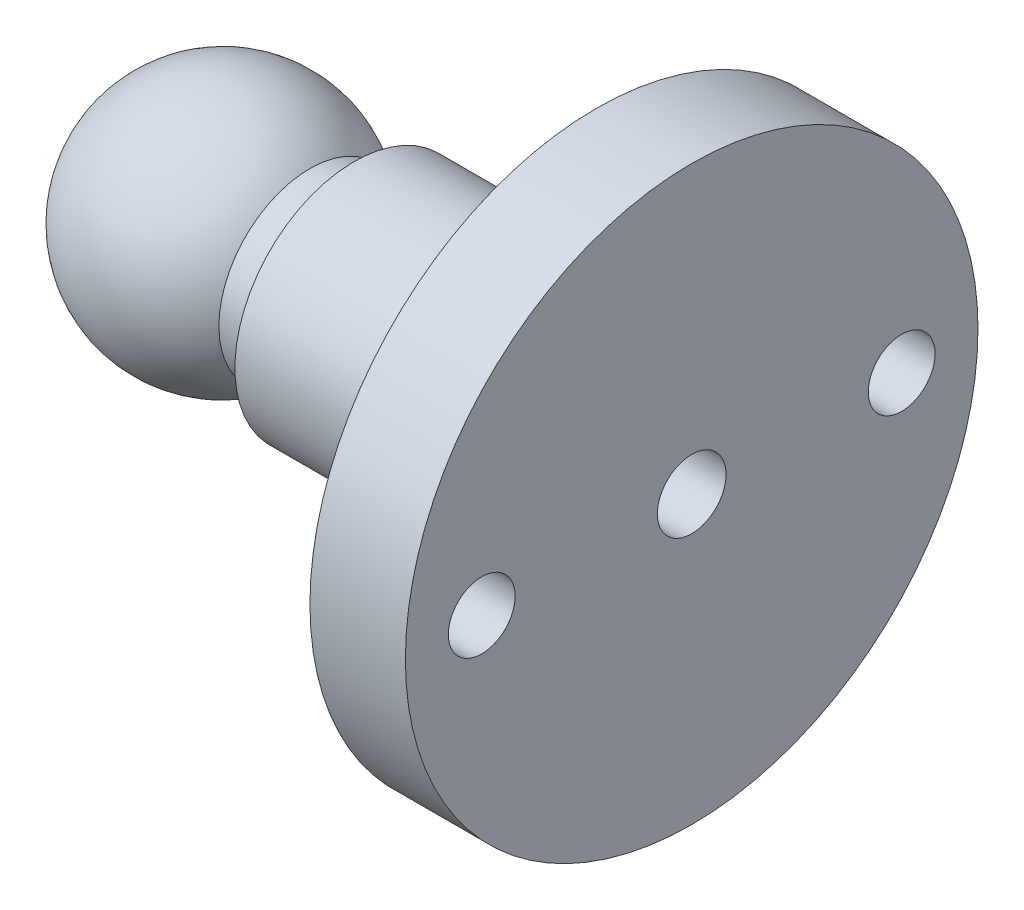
ISO-10303-21;
HEADER;
FILE_DESCRIPTION(('STEP AP214'),'2;1');
FILE_NAME('part.step','',(''),(''),'','','');
FILE_SCHEMA(('AUTOMOTIVE_DESIGN { 1 0 10303 214 1 1 1 1 }'));
ENDSEC;
DATA;
#1=APPLICATION_CONTEXT('core data for automotive mechanical design processes');
#2=APPLICATION_PROTOCOL_DEFINITION('international standard','automotive_design',2000,#1);
#3=PRODUCT_CONTEXT('',#1,'mechanical');
#4=PRODUCT('Part','Part','',(#3));
#5=PRODUCT_RELATED_PRODUCT_CATEGORY('part','',(#4));
#6=PRODUCT_DEFINITION_FORMATION('','',#4);
#7=PRODUCT_DEFINITION_CONTEXT('part definition',#1,'design');
#8=PRODUCT_DEFINITION('design','',#6,#7);
#9=PRODUCT_DEFINITION_SHAPE('','',#8);
#10=(LENGTH_UNIT() NAMED_UNIT(*) SI_UNIT(.MILLI.,.METRE.));
#11=(NAMED_UNIT(*) PLANE_ANGLE_UNIT() SI_UNIT($,.RADIAN.));
#12=(NAMED_UNIT(*) SI_UNIT($,.STERADIAN.) SOLID_ANGLE_UNIT());
#13=UNCERTAINTY_MEASURE_WITH_UNIT(LENGTH_MEASURE(1.E-05),#10,'distance_accuracy_value','');
#14=(GEOMETRIC_REPRESENTATION_CONTEXT(3) GLOBAL_UNCERTAINTY_ASSIGNED_CONTEXT((#13)) GLOBAL_UNIT_ASSIGNED_CONTEXT((#10,
#11,#12)) REPRESENTATION_CONTEXT('',''));
#15=CARTESIAN_POINT('',(0.,0.,0.));
#16=DIRECTION('',(0.,0.,1.));
#17=DIRECTION('',(1.,0.,0.));
#18=AXIS2_PLACEMENT_3D('',#15,#16,#17);
#19=CARTESIAN_POINT('',(264.840369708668,98.0251583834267,0.));
#20=DIRECTION('',(-1.,0.,0.));
#21=DIRECTION('',(0.,0.,1.));
#22=AXIS2_PLACEMENT_3D('',#19,#20,#21);
#23=PLANE('',#22);
#24=CARTESIAN_POINT('',(264.840369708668,92.5161021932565,0.));
#25=DIRECTION('',(-1.,0.,0.));
#26=DIRECTION('',(0.,0.,1.));
#27=AXIS2_PLACEMENT_3D('',#24,#25,#26);
#28=CIRCLE('',#27,4.7713832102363);
#29=CARTESIAN_POINT('',(264.840369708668,92.5161021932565,4.7713832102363));
#30=VERTEX_POINT('',#29);
#31=EDGE_CURVE('E68',#30,#30,#28,.F.);
#32=ORIENTED_EDGE('',*,*,#31,.T.);
#33=EDGE_LOOP('',(#32));
#34=FACE_BOUND('',#33,.T.);
#35=CARTESIAN_POINT('',(264.840369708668,92.5161021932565,0.));
#36=DIRECTION('',(1.,0.,0.));
#37=DIRECTION('',(0.,0.,-1.));
#38=AXIS2_PLACEMENT_3D('',#35,#36,#37);
#39=CIRCLE('',#38,6.24672917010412);
#40=CARTESIAN_POINT('',(264.840369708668,92.5161021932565,-6.24672917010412));
#41=VERTEX_POINT('',#40);
#42=EDGE_CURVE('E74',#41,#41,#39,.T.);
#43=ORIENTED_EDGE('',*,*,#42,.F.);
#44=EDGE_LOOP('',(#43));
#45=FACE_BOUND('',#44,.T.);
#46=ADVANCED_FACE('F35',(#34,#45),#23,.T.);
#47=CARTESIAN_POINT('',(271.181841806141,92.5161021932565,0.));
#48=DIRECTION('',(1.,0.,0.));
#49=DIRECTION('',(0.,0.,-1.));
#50=AXIS2_PLACEMENT_3D('',#47,#48,#49);
#51=CYLINDRICAL_SURFACE('',#50,6.24672917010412);
#52=CARTESIAN_POINT('',(277.523313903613,92.5161021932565,0.));
#53=DIRECTION('',(1.,0.,0.));
#54=DIRECTION('',(0.,0.,-1.));
#55=AXIS2_PLACEMENT_3D('',#52,#53,#54);
#56=CIRCLE('',#55,6.24672917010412);
#57=CARTESIAN_POINT('',(277.523313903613,92.5161021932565,-6.24672917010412));
#58=VERTEX_POINT('',#57);
#59=EDGE_CURVE('E92',#58,#58,#56,.T.);
#60=ORIENTED_EDGE('',*,*,#59,.F.);
#61=EDGE_LOOP('',(#60));
#62=FACE_BOUND('',#61,.T.);
#63=ORIENTED_EDGE('',*,*,#42,.T.);
#64=EDGE_LOOP('',(#63));
#65=FACE_BOUND('',#64,.T.);
#66=ADVANCED_FACE('F97',(#62,#65),#51,.T.);
#67=CARTESIAN_POINT('',(277.523313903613,103.139466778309,0.));
#68=DIRECTION('',(-1.,0.,0.));
#69=DIRECTION('',(0.,0.,1.));
#70=AXIS2_PLACEMENT_3D('',#67,#68,#69);
#71=PLANE('',#70);
#72=ORIENTED_EDGE('',*,*,#59,.T.);
#73=EDGE_LOOP('',(#72));
#74=FACE_BOUND('',#73,.T.);
#75=CARTESIAN_POINT('',(277.523313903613,92.5161021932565,0.));
#76=DIRECTION('',(1.,0.,0.));
#77=DIRECTION('',(0.,0.,-1.));
#78=AXIS2_PLACEMENT_3D('',#75,#76,#77);
#79=CIRCLE('',#78,15.);
#80=CARTESIAN_POINT('',(277.523313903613,92.5161021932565,-15.));
#81=VERTEX_POINT('',#80);
#82=EDGE_CURVE('E83',#81,#81,#79,.T.);
#83=ORIENTED_EDGE('',*,*,#82,.F.);
#84=EDGE_LOOP('',(#83));
#85=FACE_BOUND('',#84,.T.);
#86=CARTESIAN_POINT('',(277.523313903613,92.5161021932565,11.));
#87=DIRECTION('',(1.,0.,0.));
#88=DIRECTION('',(0.,0.,-1.));
#89=AXIS2_PLACEMENT_3D('',#86,#87,#88);
#90=CIRCLE('',#89,1.75);
#91=CARTESIAN_POINT('',(277.523313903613,92.5161021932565,9.25));
#92=VERTEX_POINT('',#91);
#93=EDGE_CURVE('E86',#92,#92,#90,.T.);
#94=ORIENTED_EDGE('',*,*,#93,.T.);
#95=EDGE_LOOP('',(#94));
#96=FACE_BOUND('',#95,.T.);
#97=CARTESIAN_POINT('',(277.523313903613,92.5161021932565,-11.));
#98=DIRECTION('',(1.,0.,0.));
#99=DIRECTION('',(0.,0.,-1.));
#100=AXIS2_PLACEMENT_3D('',#97,#98,#99);
#101=CIRCLE('',#100,1.75);
#102=CARTESIAN_POINT('',(277.523313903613,92.5161021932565,-12.75));
#103=VERTEX_POINT('',#102);
#104=EDGE_CURVE('E89',#103,#103,#101,.T.);
#105=ORIENTED_EDGE('',*,*,#104,.T.);
#106=EDGE_LOOP('',(#105));
#107=FACE_BOUND('',#106,.T.);
#108=ADVANCED_FACE('F106',(#74,#85,#96,#107),#71,.T.);
#109=CARTESIAN_POINT('',(277.523313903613,92.5161021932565,-11.));
#110=DIRECTION('',(1.,0.,0.));
#111=DIRECTION('',(0.,0.,-1.));
#112=AXIS2_PLACEMENT_3D('',#109,#110,#111);
#113=CYLINDRICAL_SURFACE('',#112,1.75);
#114=ORIENTED_EDGE('',*,*,#104,.F.);
#115=EDGE_LOOP('',(#114));
#116=FACE_BOUND('',#115,.T.);
#117=CARTESIAN_POINT('',(282.523313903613,92.5161021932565,-11.));
#118=DIRECTION('',(1.,0.,0.));
#119=DIRECTION('',(0.,0.,-1.));
#120=AXIS2_PLACEMENT_3D('',#117,#118,#119);
#121=CIRCLE('',#120,1.75);
#122=CARTESIAN_POINT('',(282.523313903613,92.5161021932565,-12.75));
#123=VERTEX_POINT('',#122);
#124=EDGE_CURVE('E80',#123,#123,#121,.F.);
#125=ORIENTED_EDGE('',*,*,#124,.F.);
#126=EDGE_LOOP('',(#125));
#127=FACE_BOUND('',#126,.T.);
#128=ADVANCED_FACE('F129',(#116,#127),#113,.F.);
#129=CARTESIAN_POINT('',(277.523313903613,92.5161021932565,11.));
#130=DIRECTION('',(1.,0.,0.));
#131=DIRECTION('',(0.,0.,-1.));
#132=AXIS2_PLACEMENT_3D('',#129,#130,#131);
#133=CYLINDRICAL_SURFACE('',#132,1.75);
#134=ORIENTED_EDGE('',*,*,#93,.F.);
#135=EDGE_LOOP('',(#134));
#136=FACE_BOUND('',#135,.T.);
#137=CARTESIAN_POINT('',(282.523313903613,92.5161021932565,11.));
#138=DIRECTION('',(1.,0.,0.));
#139=DIRECTION('',(0.,0.,-1.));
#140=AXIS2_PLACEMENT_3D('',#137,#138,#139);
#141=CIRCLE('',#140,1.75);
#142=CARTESIAN_POINT('',(282.523313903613,92.5161021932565,9.25));
#143=VERTEX_POINT('',#142);
#144=EDGE_CURVE('E77',#143,#143,#141,.F.);
#145=ORIENTED_EDGE('',*,*,#144,.F.);
#146=EDGE_LOOP('',(#145));
#147=FACE_BOUND('',#146,.T.);
#148=ADVANCED_FACE('F119',(#136,#147),#133,.F.);
#149=CARTESIAN_POINT('',(280.023313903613,92.5161021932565,0.));
#150=DIRECTION('',(1.,0.,0.));
#151=DIRECTION('',(0.,0.,-1.));
#152=AXIS2_PLACEMENT_3D('',#149,#150,#151);
#153=CYLINDRICAL_SURFACE('',#152,15.);
#154=CARTESIAN_POINT('',(282.523313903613,92.5161021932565,0.));
#155=DIRECTION('',(1.,0.,0.));
#156=DIRECTION('',(0.,0.,-1.));
#157=AXIS2_PLACEMENT_3D('',#154,#155,#156);
#158=CIRCLE('',#157,15.);
#159=CARTESIAN_POINT('',(282.523313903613,92.5161021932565,-15.));
#160=VERTEX_POINT('',#159);
#161=EDGE_CURVE('E44',#160,#160,#158,.T.);
#162=ORIENTED_EDGE('',*,*,#161,.F.);
#163=EDGE_LOOP('',(#162));
#164=FACE_BOUND('',#163,.T.);
#165=ORIENTED_EDGE('',*,*,#82,.T.);
#166=EDGE_LOOP('',(#165));
#167=FACE_BOUND('',#166,.T.);
#168=ADVANCED_FACE('F114',(#164,#167),#153,.T.);
#169=CARTESIAN_POINT('',(282.523313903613,100.721229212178,0.));
#170=DIRECTION('',(1.,0.,0.));
#171=DIRECTION('',(0.,0.,-1.));
#172=AXIS2_PLACEMENT_3D('',#169,#170,#171);
#173=PLANE('',#172);
#174=CARTESIAN_POINT('',(282.523313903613,92.5161021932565,0.));
#175=DIRECTION('',(1.,0.,0.));
#176=DIRECTION('',(0.,0.,-1.));
#177=AXIS2_PLACEMENT_3D('',#174,#175,#176);
#178=CIRCLE('',#177,1.8);
#179=CARTESIAN_POINT('',(282.523313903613,92.5161021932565,-1.8));
#180=VERTEX_POINT('',#179);
#181=EDGE_CURVE('E71',#180,#180,#178,.T.);
#182=ORIENTED_EDGE('',*,*,#181,.F.);
#183=EDGE_LOOP('',(#182));
#184=FACE_BOUND('',#183,.T.);
#185=ORIENTED_EDGE('',*,*,#161,.T.);
#186=EDGE_LOOP('',(#185));
#187=FACE_BOUND('',#186,.T.);
#188=ORIENTED_EDGE('',*,*,#144,.T.);
#189=EDGE_LOOP('',(#188));
#190=FACE_BOUND('',#189,.T.);
#191=ORIENTED_EDGE('',*,*,#124,.T.);
#192=EDGE_LOOP('',(#191));
#193=FACE_BOUND('',#192,.T.);
#194=ADVANCED_FACE('F37',(#184,#187,#190,#193),#173,.T.);
#195=CARTESIAN_POINT('',(264.840369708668,92.5161021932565,0.));
#196=DIRECTION('',(1.,0.,0.));
#197=DIRECTION('',(0.,0.,-1.));
#198=AXIS2_PLACEMENT_3D('',#195,#196,#197);
#199=CYLINDRICAL_SURFACE('',#198,1.8);
#200=CARTESIAN_POINT('',(277.523313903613,92.5161021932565,0.));
#201=DIRECTION('',(-1.,0.,0.));
#202=DIRECTION('',(0.,0.,1.));
#203=AXIS2_PLACEMENT_3D('',#200,#201,#202);
#204=CIRCLE('',#203,1.8);
#205=CARTESIAN_POINT('',(277.523313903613,92.5161021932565,1.8));
#206=VERTEX_POINT('',#205);
#207=EDGE_CURVE('E63',#206,#206,#204,.F.);
#208=ORIENTED_EDGE('',*,*,#207,.F.);
#209=EDGE_LOOP('',(#208));
#210=FACE_BOUND('',#209,.T.);
#211=ORIENTED_EDGE('',*,*,#181,.T.);
#212=EDGE_LOOP('',(#211));
#213=FACE_BOUND('',#212,.T.);
#214=ADVANCED_FACE('F102',(#210,#213),#199,.F.);
#215=CARTESIAN_POINT('',(277.523313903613,92.5161021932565,0.));
#216=DIRECTION('',(-1.,0.,0.));
#217=DIRECTION('',(0.,0.,1.));
#218=AXIS2_PLACEMENT_3D('',#215,#216,#217);
#219=PLANE('',#218);
#220=ORIENTED_EDGE('',*,*,#207,.T.);
#221=EDGE_LOOP('',(#220));
#222=FACE_BOUND('',#221,.T.);
#223=ADVANCED_FACE('F111',(#222),#219,.F.);
#224=CARTESIAN_POINT('',(262.523313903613,92.5161021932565,0.));
#225=DIRECTION('',(1.,0.,0.));
#226=DIRECTION('',(0.,0.,-1.));
#227=AXIS2_PLACEMENT_3D('',#224,#225,#226);
#228=CYLINDRICAL_SURFACE('',#227,4.7713832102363);
#229=ORIENTED_EDGE('',*,*,#31,.F.);
#230=EDGE_LOOP('',(#229));
#231=FACE_BOUND('',#230,.T.);
#232=CARTESIAN_POINT('',(262.523313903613,92.5161021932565,0.));
#233=DIRECTION('',(-1.,0.,0.));
#234=DIRECTION('',(0.,0.,1.));
#235=AXIS2_PLACEMENT_3D('',#232,#233,#234);
#236=CIRCLE('',#235,4.7713832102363);
#237=CARTESIAN_POINT('',(262.523313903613,92.5161021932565,4.7713832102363));
#238=VERTEX_POINT('',#237);
#239=EDGE_CURVE('E60',#238,#238,#236,.T.);
#240=ORIENTED_EDGE('',*,*,#239,.F.);
#241=EDGE_LOOP('',(#240));
#242=FACE_BOUND('',#241,.T.);
#243=ADVANCED_FACE('F176',(#231,#242),#228,.T.);
#244=CARTESIAN_POINT('',(262.523313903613,92.5161021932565,0.));
#245=DIRECTION('',(-1.,0.,0.));
#246=DIRECTION('',(0.,0.,1.));
#247=AXIS2_PLACEMENT_3D('',#244,#245,#246);
#248=PLANE('',#247);
#249=CARTESIAN_POINT('',(262.523313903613,92.5161021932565,0.));
#250=DIRECTION('',(-1.,0.,0.));
#251=DIRECTION('',(0.,0.,1.));
#252=AXIS2_PLACEMENT_3D('',#249,#250,#251);
#253=CIRCLE('',#252,4.67158375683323);
#254=CARTESIAN_POINT('',(262.523313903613,92.5161021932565,4.67158375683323));
#255=VERTEX_POINT('',#254);
#256=EDGE_CURVE('E11',#255,#255,#253,.T.);
#257=ORIENTED_EDGE('',*,*,#256,.F.);
#258=EDGE_LOOP('',(#257));
#259=FACE_BOUND('',#258,.T.);
#260=ORIENTED_EDGE('',*,*,#239,.T.);
#261=EDGE_LOOP('',(#260));
#262=FACE_BOUND('',#261,.T.);
#263=ADVANCED_FACE('F185',(#259,#262),#248,.T.);
#264=CARTESIAN_POINT('',(257.944942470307,92.5161021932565,-0.0683339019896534));
#265=DIRECTION('',(0.,-1.,0.));
#266=DIRECTION('',(0.,0.,-1.));
#267=AXIS2_PLACEMENT_3D('',#264,#265,#266);
#268=CIRCLE('',#267,6.49241050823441);
#269=TRIMMED_CURVE('',#268,(PARAMETER_VALUE(-1.58132171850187)),
(PARAMETER_VALUE(1.58132171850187)),.T.,.PARAMETER.);
#270=CARTESIAN_POINT('',(257.944942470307,92.5161021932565,0.));
#271=DIRECTION('',(1.,0.,0.));
#272=AXIS1_PLACEMENT('',#270,#271);
#273=SURFACE_OF_REVOLUTION('',#269,#272);
#274=CARTESIAN_POINT('',(251.452891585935,92.5161021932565,0.));
#275=VERTEX_POINT('',#274);
#276=VERTEX_LOOP('',#275);
#277=FACE_BOUND('',#276,.T.);
#278=ORIENTED_EDGE('',*,*,#256,.T.);
#279=EDGE_LOOP('',(#278));
#280=FACE_BOUND('',#279,.T.);
#281=ADVANCED_FACE('F195',(#277,#280),#273,.T.);
#282=CLOSED_SHELL('',(#46,#66,#108,#128,#148,#168,#194,#214,#223,#243,#263,#281));
#283=CARTESIAN_POINT('',(262.523313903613,92.5161021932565,0.));
#284=DIRECTION('',(1.,0.,0.));
#285=DIRECTION('',(0.,0.,-1.));
#286=AXIS2_PLACEMENT_3D('',#283,#284,#285);
#287=CIRCLE('',#286,4.38492341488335);
#288=CARTESIAN_POINT('',(262.523313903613,92.5161021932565,-4.38492341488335));
#289=VERTEX_POINT('',#288);
#290=EDGE_CURVE('E58',#289,#289,#287,.T.);
#291=ORIENTED_EDGE('',*,*,#290,.F.);
#292=EDGE_LOOP('',(#291));
#293=FACE_BOUND('',#292,.T.);
#294=ADVANCED_FACE('F53',(#293),#248,.T.);
#295=CARTESIAN_POINT('',(257.944942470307,92.5161021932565,-0.0683339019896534));
#296=DIRECTION('',(0.,-1.,0.));
#297=DIRECTION('',(0.,0.,-1.));
#298=AXIS2_PLACEMENT_3D('',#295,#296,#297);
#299=CIRCLE('',#298,6.29241050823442);
#300=TRIMMED_CURVE('',#299,(PARAMETER_VALUE(-1.58165627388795)),
(PARAMETER_VALUE(1.58165627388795)),.T.,.PARAMETER.);
#301=CARTESIAN_POINT('',(257.944942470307,92.5161021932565,0.));
#302=DIRECTION('',(1.,0.,0.));
#303=AXIS1_PLACEMENT('',#301,#302);
#304=SURFACE_OF_REVOLUTION('',#300,#303);
#305=CARTESIAN_POINT('',(251.652903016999,92.5161021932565,0.));
#306=VERTEX_POINT('',#305);
#307=VERTEX_LOOP('',#306);
#308=FACE_BOUND('',#307,.T.);
#309=ORIENTED_EDGE('',*,*,#290,.T.);
#310=EDGE_LOOP('',(#309));
#311=FACE_BOUND('',#310,.T.);
#312=ADVANCED_FACE('F50',(#308,#311),#304,.F.);
#313=CLOSED_SHELL('',(#294,#312));
#314=ORIENTED_CLOSED_SHELL('',*,#313,.T.);
#315=BREP_WITH_VOIDS('B2',#282,(#314));
#316=ADVANCED_BREP_SHAPE_REPRESENTATION('',(#18,#315),#14);
#317=SHAPE_DEFINITION_REPRESENTATION(#9,#316);
ENDSEC;
END-ISO-10303-21;
